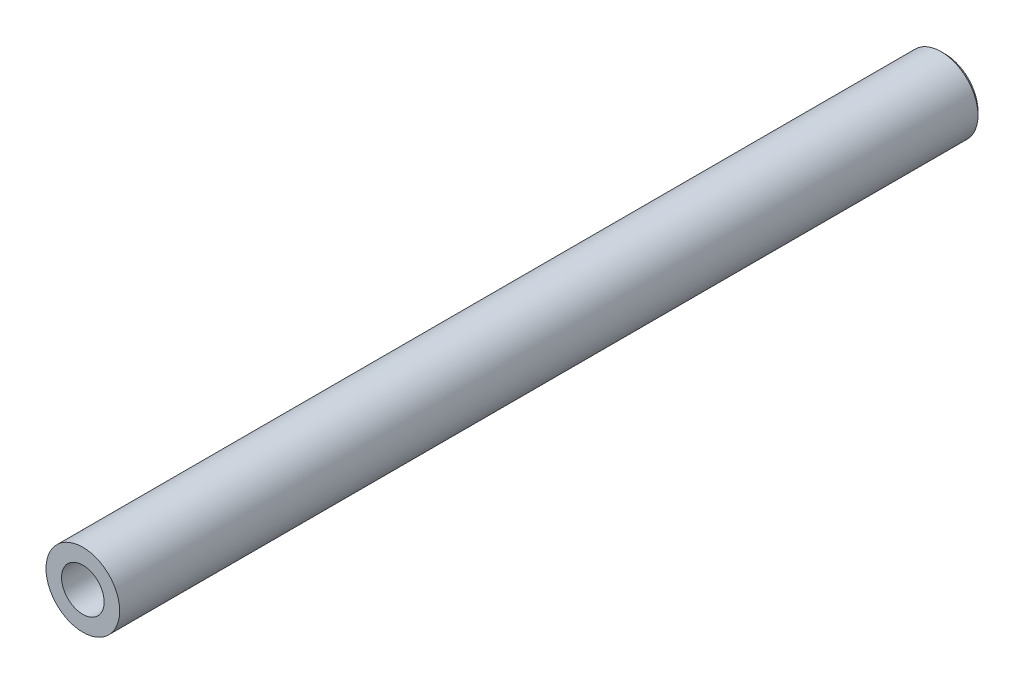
ISO-10303-21;
HEADER;
FILE_DESCRIPTION(('STEP AP214'),'2;1');
FILE_NAME('part.step','',(''),(''),'','','');
FILE_SCHEMA(('AUTOMOTIVE_DESIGN { 1 0 10303 214 1 1 1 1 }'));
ENDSEC;
DATA;
#1=APPLICATION_CONTEXT('core data for automotive mechanical design processes');
#2=APPLICATION_PROTOCOL_DEFINITION('international standard','automotive_design',2000,#1);
#3=PRODUCT_CONTEXT('',#1,'mechanical');
#4=PRODUCT('Part','Part','',(#3));
#5=PRODUCT_RELATED_PRODUCT_CATEGORY('part','',(#4));
#6=PRODUCT_DEFINITION_FORMATION('','',#4);
#7=PRODUCT_DEFINITION_CONTEXT('part definition',#1,'design');
#8=PRODUCT_DEFINITION('design','',#6,#7);
#9=PRODUCT_DEFINITION_SHAPE('','',#8);
#10=(LENGTH_UNIT() NAMED_UNIT(*) SI_UNIT(.MILLI.,.METRE.));
#11=(NAMED_UNIT(*) PLANE_ANGLE_UNIT() SI_UNIT($,.RADIAN.));
#12=(NAMED_UNIT(*) SI_UNIT($,.STERADIAN.) SOLID_ANGLE_UNIT());
#13=UNCERTAINTY_MEASURE_WITH_UNIT(LENGTH_MEASURE(1.E-05),#10,'distance_accuracy_value','');
#14=(GEOMETRIC_REPRESENTATION_CONTEXT(3) GLOBAL_UNCERTAINTY_ASSIGNED_CONTEXT((#13)) GLOBAL_UNIT_ASSIGNED_CONTEXT((#10,
#11,#12)) REPRESENTATION_CONTEXT('',''));
#15=CARTESIAN_POINT('',(0.,0.,0.));
#16=DIRECTION('',(0.,0.,1.));
#17=DIRECTION('',(1.,0.,0.));
#18=AXIS2_PLACEMENT_3D('',#15,#16,#17);
#19=CARTESIAN_POINT('',(0.,0.,-69.85));
#20=DIRECTION('',(0.,0.,1.));
#21=DIRECTION('',(1.,0.,0.));
#22=AXIS2_PLACEMENT_3D('',#19,#20,#21);
#23=CYLINDRICAL_SURFACE('',#22,2.9845);
#24=CARTESIAN_POINT('',(0.,0.,-69.55155));
#25=DIRECTION('',(0.,0.,-1.));
#26=DIRECTION('',(-1.,0.,0.));
#27=AXIS2_PLACEMENT_3D('',#24,#25,#26);
#28=CIRCLE('',#27,2.9845);
#29=CARTESIAN_POINT('',(2.98450000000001,0.,-69.55155));
#30=VERTEX_POINT('',#29);
#31=EDGE_CURVE('E11',#30,#30,#28,.F.);
#32=ORIENTED_EDGE('',*,*,#31,.T.);
#33=EDGE_LOOP('',(#32));
#34=FACE_BOUND('',#33,.T.);
#35=CARTESIAN_POINT('',(0.,0.,0.));
#36=DIRECTION('',(0.,0.,-1.));
#37=DIRECTION('',(-1.,0.,0.));
#38=AXIS2_PLACEMENT_3D('',#35,#36,#37);
#39=CIRCLE('',#38,2.9845);
#40=CARTESIAN_POINT('',(-2.9845,0.,0.));
#41=VERTEX_POINT('',#40);
#42=EDGE_CURVE('E70',#41,#41,#39,.T.);
#43=ORIENTED_EDGE('',*,*,#42,.T.);
#44=EDGE_LOOP('',(#43));
#45=FACE_BOUND('',#44,.T.);
#46=ADVANCED_FACE('F35',(#34,#45),#23,.T.);
#47=CARTESIAN_POINT('',(0.,0.,-69.85));
#48=DIRECTION('',(0.,0.,-1.));
#49=DIRECTION('',(-1.,0.,0.));
#50=AXIS2_PLACEMENT_3D('',#47,#48,#49);
#51=PLANE('',#50);
#52=CARTESIAN_POINT('',(0.,0.,-69.85));
#53=DIRECTION('',(0.,0.,-1.));
#54=DIRECTION('',(-1.,0.,0.));
#55=AXIS2_PLACEMENT_3D('',#52,#53,#54);
#56=CIRCLE('',#55,2.38125);
#57=CARTESIAN_POINT('',(-2.38125,0.,-69.85));
#58=VERTEX_POINT('',#57);
#59=EDGE_CURVE('E59',#58,#58,#56,.T.);
#60=ORIENTED_EDGE('',*,*,#59,.F.);
#61=EDGE_LOOP('',(#60));
#62=FACE_BOUND('',#61,.T.);
#63=CARTESIAN_POINT('',(0.,0.,-69.85));
#64=DIRECTION('',(0.,0.,-1.));
#65=DIRECTION('',(-1.,0.,0.));
#66=AXIS2_PLACEMENT_3D('',#63,#64,#65);
#67=CIRCLE('',#66,2.68605);
#68=CARTESIAN_POINT('',(2.68605000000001,0.,-69.85));
#69=VERTEX_POINT('',#68);
#70=EDGE_CURVE('E43',#69,#69,#67,.T.);
#71=ORIENTED_EDGE('',*,*,#70,.T.);
#72=EDGE_LOOP('',(#71));
#73=FACE_BOUND('',#72,.T.);
#74=ADVANCED_FACE('F75',(#62,#73),#51,.T.);
#75=CARTESIAN_POINT('',(0.,0.,0.));
#76=DIRECTION('',(0.,0.,-1.));
#77=DIRECTION('',(-1.,0.,0.));
#78=AXIS2_PLACEMENT_3D('',#75,#76,#77);
#79=PLANE('',#78);
#80=CARTESIAN_POINT('',(0.,0.,0.));
#81=DIRECTION('',(0.,0.,1.));
#82=DIRECTION('',(1.,0.,0.));
#83=AXIS2_PLACEMENT_3D('',#80,#81,#82);
#84=CIRCLE('',#83,1.7272);
#85=CARTESIAN_POINT('',(1.7272,0.,0.));
#86=VERTEX_POINT('',#85);
#87=EDGE_CURVE('E60',#86,#86,#84,.T.);
#88=ORIENTED_EDGE('',*,*,#87,.F.);
#89=EDGE_LOOP('',(#88));
#90=FACE_BOUND('',#89,.T.);
#91=ORIENTED_EDGE('',*,*,#42,.F.);
#92=EDGE_LOOP('',(#91));
#93=FACE_BOUND('',#92,.T.);
#94=ADVANCED_FACE('F79',(#90,#93),#79,.F.);
#95=CARTESIAN_POINT('',(0.,0.,-69.85));
#96=DIRECTION('',(0.,0.,1.));
#97=DIRECTION('',(1.,0.,0.));
#98=AXIS2_PLACEMENT_3D('',#95,#96,#97);
#99=CONICAL_SURFACE('',#98,2.68605,0.785398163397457);
#100=CARTESIAN_POINT('',(2.98450000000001,0.,-69.55155));
#101=CARTESIAN_POINT('',(2.98139114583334,0.,-69.5546588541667));
#102=CARTESIAN_POINT('',(2.97828229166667,0.,-69.5577677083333));
#103=CARTESIAN_POINT('',(2.97206458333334,0.,-69.5639854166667));
#104=CARTESIAN_POINT('',(2.96895572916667,0.,-69.5670942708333));
#105=CARTESIAN_POINT('',(2.96273802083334,0.,-69.5733119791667));
#106=CARTESIAN_POINT('',(2.95962916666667,0.,-69.5764208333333));
#107=CARTESIAN_POINT('',(2.95341145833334,0.,-69.5826385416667));
#108=CARTESIAN_POINT('',(2.95030260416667,0.,-69.5857473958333));
#109=CARTESIAN_POINT('',(2.94408489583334,0.,-69.5919651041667));
#110=CARTESIAN_POINT('',(2.94097604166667,0.,-69.5950739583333));
#111=CARTESIAN_POINT('',(2.93475833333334,0.,-69.6012916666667));
#112=CARTESIAN_POINT('',(2.93164947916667,0.,-69.6044005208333));
#113=CARTESIAN_POINT('',(2.92543177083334,0.,-69.6106182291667));
#114=CARTESIAN_POINT('',(2.92232291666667,0.,-69.6137270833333));
#115=CARTESIAN_POINT('',(2.91610520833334,0.,-69.6199447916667));
#116=CARTESIAN_POINT('',(2.91299635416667,0.,-69.6230536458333));
#117=CARTESIAN_POINT('',(2.90677864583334,0.,-69.6292713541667));
#118=CARTESIAN_POINT('',(2.90366979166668,0.,-69.6323802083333));
#119=CARTESIAN_POINT('',(2.89745208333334,0.,-69.6385979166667));
#120=CARTESIAN_POINT('',(2.89434322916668,0.,-69.6417067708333));
#121=CARTESIAN_POINT('',(2.88812552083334,0.,-69.6479244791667));
#122=CARTESIAN_POINT('',(2.88501666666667,0.,-69.6510333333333));
#123=CARTESIAN_POINT('',(2.87879895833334,0.,-69.6572510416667));
#124=CARTESIAN_POINT('',(2.87569010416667,0.,-69.6603598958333));
#125=CARTESIAN_POINT('',(2.86947239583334,0.,-69.6665776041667));
#126=CARTESIAN_POINT('',(2.86636354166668,0.,-69.6696864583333));
#127=CARTESIAN_POINT('',(2.86014583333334,0.,-69.6759041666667));
#128=CARTESIAN_POINT('',(2.85703697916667,0.,-69.6790130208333));
#129=CARTESIAN_POINT('',(2.85081927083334,0.,-69.6852307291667));
#130=CARTESIAN_POINT('',(2.84771041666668,0.,-69.6883395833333));
#131=CARTESIAN_POINT('',(2.84149270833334,0.,-69.6945572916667));
#132=CARTESIAN_POINT('',(2.83838385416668,0.,-69.6976661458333));
#133=CARTESIAN_POINT('',(2.83216614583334,0.,-69.7038838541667));
#134=CARTESIAN_POINT('',(2.82905729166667,0.,-69.7069927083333));
#135=CARTESIAN_POINT('',(2.82283958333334,0.,-69.7132104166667));
#136=CARTESIAN_POINT('',(2.81973072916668,0.,-69.7163192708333));
#137=CARTESIAN_POINT('',(2.81351302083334,0.,-69.7225369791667));
#138=CARTESIAN_POINT('',(2.81040416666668,0.,-69.7256458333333));
#139=CARTESIAN_POINT('',(2.80418645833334,0.,-69.7318635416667));
#140=CARTESIAN_POINT('',(2.80107760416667,0.,-69.7349723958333));
#141=CARTESIAN_POINT('',(2.79485989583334,0.,-69.7411901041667));
#142=CARTESIAN_POINT('',(2.79175104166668,0.,-69.7442989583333));
#143=CARTESIAN_POINT('',(2.78553333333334,0.,-69.7505166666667));
#144=CARTESIAN_POINT('',(2.78242447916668,0.,-69.7536255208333));
#145=CARTESIAN_POINT('',(2.77620677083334,0.,-69.7598432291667));
#146=CARTESIAN_POINT('',(2.77309791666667,0.,-69.7629520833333));
#147=CARTESIAN_POINT('',(2.76688020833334,0.,-69.7691697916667));
#148=CARTESIAN_POINT('',(2.76377135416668,0.,-69.7722786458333));
#149=CARTESIAN_POINT('',(2.75755364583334,0.,-69.7784963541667));
#150=CARTESIAN_POINT('',(2.75444479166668,0.,-69.7816052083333));
#151=CARTESIAN_POINT('',(2.74822708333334,0.,-69.7878229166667));
#152=CARTESIAN_POINT('',(2.74511822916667,0.,-69.7909317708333));
#153=CARTESIAN_POINT('',(2.73890052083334,0.,-69.7971494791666));
#154=CARTESIAN_POINT('',(2.73579166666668,0.,-69.8002583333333));
#155=CARTESIAN_POINT('',(2.72957395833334,0.,-69.8064760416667));
#156=CARTESIAN_POINT('',(2.72646510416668,0.,-69.8095848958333));
#157=CARTESIAN_POINT('',(2.72024739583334,0.,-69.8158026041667));
#158=CARTESIAN_POINT('',(2.71713854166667,0.,-69.8189114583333));
#159=CARTESIAN_POINT('',(2.71092083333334,0.,-69.8251291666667));
#160=CARTESIAN_POINT('',(2.70781197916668,0.,-69.8282380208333));
#161=CARTESIAN_POINT('',(2.70159427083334,0.,-69.8344557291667));
#162=CARTESIAN_POINT('',(2.69848541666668,0.,-69.8375645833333));
#163=CARTESIAN_POINT('',(2.69226770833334,0.,-69.8437822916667));
#164=CARTESIAN_POINT('',(2.68915885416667,0.,-69.8468911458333));
#165=CARTESIAN_POINT('',(2.68605000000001,0.,-69.85));
#166=B_SPLINE_CURVE_WITH_KNOTS('',3,(#100,#101,#102,#103,#104,#105,#106,#107,#108,#109,#110,
#111,#112,#113,#114,#115,#116,#117,#118,#119,#120,#121,#122,#123,#124,#125,#126,#127,#128,#129,
#130,#131,#132,#133,#134,#135,#136,#137,#138,#139,#140,#141,#142,#143,#144,#145,#146,#147,#148,
#149,#150,#151,#152,#153,#154,#155,#156,#157,#158,#159,#160,#161,#162,#163,#164,#165),
.UNSPECIFIED.,.F.,.F.,(4,2,2,2,2,2,2,2,2,2,2,2,2,2,2,2,2,2,2,2,2,2,2,2,2,2,2,2,2,2,2,2,4),(0.,
0.0131897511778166,0.0263795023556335,0.0395692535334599,0.0527590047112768,0.0659487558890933,
0.0791385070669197,0.0923282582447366,0.105518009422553,0.11870776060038,0.131897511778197,
0.145087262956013,0.15827701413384,0.171466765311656,0.184656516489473,0.1978462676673,
0.211036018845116,0.224225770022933,0.23741552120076,0.250605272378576,0.263795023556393,
0.276984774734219,0.290174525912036,0.303364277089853,0.316554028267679,0.329743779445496,
0.342933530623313,0.356123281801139,0.369313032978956,0.382502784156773,0.395692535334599,
0.408882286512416,0.422072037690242),.UNSPECIFIED.);
#167=EDGE_CURVE('BSEAM37',#30,#69,#166,.T.);
#168=ORIENTED_EDGE('',*,*,#31,.F.);
#169=ORIENTED_EDGE('',*,*,#70,.F.);
#170=ORIENTED_EDGE('',*,*,#167,.T.);
#171=ORIENTED_EDGE('',*,*,#167,.F.);
#172=EDGE_LOOP('',(#168,#170,#169,#171));
#173=FACE_BOUND('',#172,.T.);
#174=ADVANCED_FACE('F37',(#173),#99,.T.);
#175=CARTESIAN_POINT('',(0.,0.,-63.5));
#176=DIRECTION('',(0.,0.,-1.));
#177=DIRECTION('',(-1.,0.,0.));
#178=AXIS2_PLACEMENT_3D('',#175,#176,#177);
#179=CONICAL_SURFACE('',#178,2.38125,1.02974425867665);
#180=CARTESIAN_POINT('',(0.,0.,-62.0692006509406));
#181=VERTEX_POINT('',#180);
#182=VERTEX_LOOP('',#181);
#183=FACE_BOUND('',#182,.T.);
#184=CARTESIAN_POINT('',(0.,0.,-63.5));
#185=DIRECTION('',(0.,0.,-1.));
#186=DIRECTION('',(-1.,0.,0.));
#187=AXIS2_PLACEMENT_3D('',#184,#185,#186);
#188=CIRCLE('',#187,2.38125);
#189=CARTESIAN_POINT('',(-2.38125,0.,-63.5));
#190=VERTEX_POINT('',#189);
#191=EDGE_CURVE('E63',#190,#190,#188,.T.);
#192=ORIENTED_EDGE('',*,*,#191,.T.);
#193=EDGE_LOOP('',(#192));
#194=FACE_BOUND('',#193,.T.);
#195=ADVANCED_FACE('F78',(#183,#194),#179,.F.);
#196=CARTESIAN_POINT('',(0.,0.,-69.85));
#197=DIRECTION('',(0.,0.,-1.));
#198=DIRECTION('',(-1.,0.,0.));
#199=AXIS2_PLACEMENT_3D('',#196,#197,#198);
#200=CYLINDRICAL_SURFACE('',#199,2.38125);
#201=ORIENTED_EDGE('',*,*,#191,.F.);
#202=EDGE_LOOP('',(#201));
#203=FACE_BOUND('',#202,.T.);
#204=ORIENTED_EDGE('',*,*,#59,.T.);
#205=EDGE_LOOP('',(#204));
#206=FACE_BOUND('',#205,.T.);
#207=ADVANCED_FACE('F53',(#203,#206),#200,.F.);
#208=CARTESIAN_POINT('',(0.,0.,-16.51));
#209=DIRECTION('',(0.,0.,1.));
#210=DIRECTION('',(1.,0.,0.));
#211=AXIS2_PLACEMENT_3D('',#208,#209,#210);
#212=CONICAL_SURFACE('',#211,1.7272,1.02974425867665);
#213=CARTESIAN_POINT('',(0.,0.,-17.5478064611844));
#214=VERTEX_POINT('',#213);
#215=VERTEX_LOOP('',#214);
#216=FACE_BOUND('',#215,.T.);
#217=CARTESIAN_POINT('',(0.,0.,-16.51));
#218=DIRECTION('',(0.,0.,1.));
#219=DIRECTION('',(1.,0.,0.));
#220=AXIS2_PLACEMENT_3D('',#217,#218,#219);
#221=CIRCLE('',#220,1.7272);
#222=CARTESIAN_POINT('',(1.7272,0.,-16.51));
#223=VERTEX_POINT('',#222);
#224=EDGE_CURVE('E57',#223,#223,#221,.T.);
#225=ORIENTED_EDGE('',*,*,#224,.T.);
#226=EDGE_LOOP('',(#225));
#227=FACE_BOUND('',#226,.T.);
#228=ADVANCED_FACE('F49',(#216,#227),#212,.F.);
#229=CARTESIAN_POINT('',(0.,0.,0.));
#230=DIRECTION('',(0.,0.,1.));
#231=DIRECTION('',(1.,0.,0.));
#232=AXIS2_PLACEMENT_3D('',#229,#230,#231);
#233=CYLINDRICAL_SURFACE('',#232,1.7272);
#234=ORIENTED_EDGE('',*,*,#224,.F.);
#235=EDGE_LOOP('',(#234));
#236=FACE_BOUND('',#235,.T.);
#237=ORIENTED_EDGE('',*,*,#87,.T.);
#238=EDGE_LOOP('',(#237));
#239=FACE_BOUND('',#238,.T.);
#240=ADVANCED_FACE('F52',(#236,#239),#233,.F.);
#241=CLOSED_SHELL('',(#46,#74,#94,#174,#195,#207,#228,#240));
#242=MANIFOLD_SOLID_BREP('B2',#241);
#243=ADVANCED_BREP_SHAPE_REPRESENTATION('',(#18,#242),#14);
#244=SHAPE_DEFINITION_REPRESENTATION(#9,#243);
ENDSEC;
END-ISO-10303-21;
